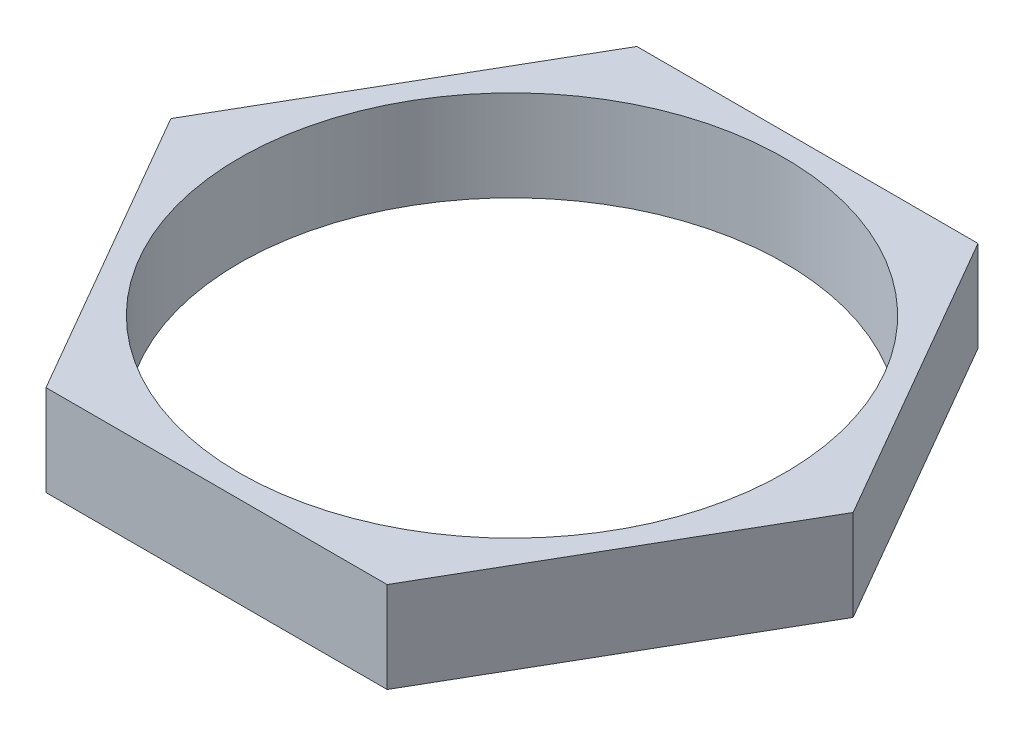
ISO-10303-21;
HEADER;
FILE_DESCRIPTION(('STEP AP214'),'2;1');
FILE_NAME('part.step','',(''),(''),'','','');
FILE_SCHEMA(('AUTOMOTIVE_DESIGN { 1 0 10303 214 1 1 1 1 }'));
ENDSEC;
DATA;
#1=APPLICATION_CONTEXT('core data for automotive mechanical design processes');
#2=APPLICATION_PROTOCOL_DEFINITION('international standard','automotive_design',2000,#1);
#3=PRODUCT_CONTEXT('',#1,'mechanical');
#4=PRODUCT('Part','Part','',(#3));
#5=PRODUCT_RELATED_PRODUCT_CATEGORY('part','',(#4));
#6=PRODUCT_DEFINITION_FORMATION('','',#4);
#7=PRODUCT_DEFINITION_CONTEXT('part definition',#1,'design');
#8=PRODUCT_DEFINITION('design','',#6,#7);
#9=PRODUCT_DEFINITION_SHAPE('','',#8);
#10=(LENGTH_UNIT() NAMED_UNIT(*) SI_UNIT(.MILLI.,.METRE.));
#11=(NAMED_UNIT(*) PLANE_ANGLE_UNIT() SI_UNIT($,.RADIAN.));
#12=(NAMED_UNIT(*) SI_UNIT($,.STERADIAN.) SOLID_ANGLE_UNIT());
#13=UNCERTAINTY_MEASURE_WITH_UNIT(LENGTH_MEASURE(1.E-05),#10,'distance_accuracy_value','');
#14=(GEOMETRIC_REPRESENTATION_CONTEXT(3) GLOBAL_UNCERTAINTY_ASSIGNED_CONTEXT((#13)) GLOBAL_UNIT_ASSIGNED_CONTEXT((#10,
#11,#12)) REPRESENTATION_CONTEXT('',''));
#15=CARTESIAN_POINT('',(0.,0.,0.));
#16=DIRECTION('',(0.,0.,1.));
#17=DIRECTION('',(1.,0.,0.));
#18=AXIS2_PLACEMENT_3D('',#15,#16,#17);
#19=CARTESIAN_POINT('',(5.62916512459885,3.,9.75));
#20=DIRECTION('',(0.,1.,0.));
#21=DIRECTION('',(0.,0.,1.));
#22=AXIS2_PLACEMENT_3D('',#19,#20,#21);
#23=PLANE('',#22);
#24=DIRECTION('',(1.,0.,0.));
#25=VECTOR('',#24,1.);
#26=CARTESIAN_POINT('',(-5.62916512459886,3.,9.75));
#27=LINE('',#26,#25);
#28=CARTESIAN_POINT('',(-5.62916512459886,3.,9.75));
#29=VERTEX_POINT('',#28);
#30=CARTESIAN_POINT('',(5.62916512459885,3.,9.75));
#31=VERTEX_POINT('',#30);
#32=EDGE_CURVE('E133',#29,#31,#27,.T.);
#33=ORIENTED_EDGE('',*,*,#32,.T.);
#34=DIRECTION('',(0.5,0.,-0.866025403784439));
#35=VECTOR('',#34,1.);
#36=CARTESIAN_POINT('',(5.62916512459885,3.,9.75));
#37=LINE('',#36,#35);
#38=CARTESIAN_POINT('',(11.2583302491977,3.,0.));
#39=VERTEX_POINT('',#38);
#40=EDGE_CURVE('E91',#31,#39,#37,.T.);
#41=ORIENTED_EDGE('',*,*,#40,.T.);
#42=DIRECTION('',(-0.5,0.,-0.866025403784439));
#43=VECTOR('',#42,1.);
#44=CARTESIAN_POINT('',(11.2583302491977,3.,0.));
#45=LINE('',#44,#43);
#46=CARTESIAN_POINT('',(5.62916512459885,3.,-9.75));
#47=VERTEX_POINT('',#46);
#48=EDGE_CURVE('E104',#39,#47,#45,.T.);
#49=ORIENTED_EDGE('',*,*,#48,.T.);
#50=DIRECTION('',(-1.,0.,0.));
#51=VECTOR('',#50,1.);
#52=CARTESIAN_POINT('',(5.62916512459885,3.,-9.75));
#53=LINE('',#52,#51);
#54=CARTESIAN_POINT('',(-5.62916512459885,3.,-9.75));
#55=VERTEX_POINT('',#54);
#56=EDGE_CURVE('E98',#47,#55,#53,.T.);
#57=ORIENTED_EDGE('',*,*,#56,.T.);
#58=DIRECTION('',(-0.5,0.,0.866025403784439));
#59=VECTOR('',#58,1.);
#60=CARTESIAN_POINT('',(-5.62916512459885,3.,-9.75));
#61=LINE('',#60,#59);
#62=CARTESIAN_POINT('',(-11.2583302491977,3.,0.));
#63=VERTEX_POINT('',#62);
#64=EDGE_CURVE('E102',#55,#63,#61,.T.);
#65=ORIENTED_EDGE('',*,*,#64,.T.);
#66=DIRECTION('',(0.5,0.,0.866025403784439));
#67=VECTOR('',#66,1.);
#68=CARTESIAN_POINT('',(-11.2583302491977,3.,0.));
#69=LINE('',#68,#67);
#70=EDGE_CURVE('E54',#63,#29,#69,.T.);
#71=ORIENTED_EDGE('',*,*,#70,.T.);
#72=EDGE_LOOP('',(#33,#41,#49,#57,#65,#71));
#73=FACE_BOUND('',#72,.T.);
#74=CARTESIAN_POINT('',(0.,3.,0.));
#75=DIRECTION('',(0.,1.,0.));
#76=DIRECTION('',(0.,0.,1.));
#77=AXIS2_PLACEMENT_3D('',#74,#75,#76);
#78=CIRCLE('',#77,9.);
#79=CARTESIAN_POINT('',(0.,3.,9.));
#80=VERTEX_POINT('',#79);
#81=EDGE_CURVE('E126',#80,#80,#78,.T.);
#82=ORIENTED_EDGE('',*,*,#81,.F.);
#83=EDGE_LOOP('',(#82));
#84=FACE_BOUND('',#83,.T.);
#85=ADVANCED_FACE('F37',(#73,#84),#23,.T.);
#86=CARTESIAN_POINT('',(5.62916512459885,0.,9.75));
#87=DIRECTION('',(0.,1.,0.));
#88=DIRECTION('',(0.,0.,1.));
#89=AXIS2_PLACEMENT_3D('',#86,#87,#88);
#90=PLANE('',#89);
#91=DIRECTION('',(1.,0.,0.));
#92=VECTOR('',#91,1.);
#93=CARTESIAN_POINT('',(-5.62916512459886,0.,9.75));
#94=LINE('',#93,#92);
#95=CARTESIAN_POINT('',(-5.62916512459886,0.,9.75));
#96=VERTEX_POINT('',#95);
#97=CARTESIAN_POINT('',(5.62916512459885,0.,9.75));
#98=VERTEX_POINT('',#97);
#99=EDGE_CURVE('E122',#96,#98,#94,.T.);
#100=ORIENTED_EDGE('',*,*,#99,.F.);
#101=DIRECTION('',(0.5,0.,0.866025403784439));
#102=VECTOR('',#101,1.);
#103=CARTESIAN_POINT('',(-11.2583302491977,0.,0.));
#104=LINE('',#103,#102);
#105=CARTESIAN_POINT('',(-11.2583302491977,0.,0.));
#106=VERTEX_POINT('',#105);
#107=EDGE_CURVE('E83',#106,#96,#104,.T.);
#108=ORIENTED_EDGE('',*,*,#107,.F.);
#109=DIRECTION('',(-0.5,0.,0.866025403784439));
#110=VECTOR('',#109,1.);
#111=CARTESIAN_POINT('',(-5.62916512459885,0.,-9.75));
#112=LINE('',#111,#110);
#113=CARTESIAN_POINT('',(-5.62916512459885,0.,-9.75));
#114=VERTEX_POINT('',#113);
#115=EDGE_CURVE('E77',#114,#106,#112,.T.);
#116=ORIENTED_EDGE('',*,*,#115,.F.);
#117=DIRECTION('',(-1.,0.,0.));
#118=VECTOR('',#117,1.);
#119=CARTESIAN_POINT('',(5.62916512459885,0.,-9.75));
#120=LINE('',#119,#118);
#121=CARTESIAN_POINT('',(5.62916512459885,0.,-9.75));
#122=VERTEX_POINT('',#121);
#123=EDGE_CURVE('E112',#122,#114,#120,.T.);
#124=ORIENTED_EDGE('',*,*,#123,.F.);
#125=DIRECTION('',(-0.5,0.,-0.866025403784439));
#126=VECTOR('',#125,1.);
#127=CARTESIAN_POINT('',(11.2583302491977,0.,0.));
#128=LINE('',#127,#126);
#129=CARTESIAN_POINT('',(11.2583302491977,0.,0.));
#130=VERTEX_POINT('',#129);
#131=EDGE_CURVE('E128',#130,#122,#128,.T.);
#132=ORIENTED_EDGE('',*,*,#131,.F.);
#133=DIRECTION('',(0.5,0.,-0.866025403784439));
#134=VECTOR('',#133,1.);
#135=CARTESIAN_POINT('',(5.62916512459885,0.,9.75));
#136=LINE('',#135,#134);
#137=EDGE_CURVE('E125',#98,#130,#136,.T.);
#138=ORIENTED_EDGE('',*,*,#137,.F.);
#139=EDGE_LOOP('',(#100,#108,#116,#124,#132,#138));
#140=FACE_BOUND('',#139,.T.);
#141=CARTESIAN_POINT('',(0.,0.,0.));
#142=DIRECTION('',(0.,1.,0.));
#143=DIRECTION('',(0.,0.,1.));
#144=AXIS2_PLACEMENT_3D('',#141,#142,#143);
#145=CIRCLE('',#144,9.);
#146=CARTESIAN_POINT('',(0.,0.,9.));
#147=VERTEX_POINT('',#146);
#148=EDGE_CURVE('E226',#147,#147,#145,.T.);
#149=ORIENTED_EDGE('',*,*,#148,.T.);
#150=EDGE_LOOP('',(#149));
#151=FACE_BOUND('',#150,.T.);
#152=ADVANCED_FACE('F142',(#140,#151),#90,.F.);
#153=CARTESIAN_POINT('',(-5.62916512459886,3.,9.75));
#154=DIRECTION('',(0.,0.,-1.));
#155=DIRECTION('',(-1.,0.,0.));
#156=AXIS2_PLACEMENT_3D('',#153,#154,#155);
#157=PLANE('',#156);
#158=ORIENTED_EDGE('',*,*,#99,.T.);
#159=DIRECTION('',(0.,-1.,0.));
#160=VECTOR('',#159,1.);
#161=CARTESIAN_POINT('',(5.62916512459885,3.,9.75));
#162=LINE('',#161,#160);
#163=EDGE_CURVE('E11',#31,#98,#162,.T.);
#164=ORIENTED_EDGE('',*,*,#163,.F.);
#165=ORIENTED_EDGE('',*,*,#32,.F.);
#166=DIRECTION('',(0.,-1.,0.));
#167=VECTOR('',#166,1.);
#168=CARTESIAN_POINT('',(-5.62916512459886,3.,9.75));
#169=LINE('',#168,#167);
#170=EDGE_CURVE('E118',#29,#96,#169,.T.);
#171=ORIENTED_EDGE('',*,*,#170,.T.);
#172=EDGE_LOOP('',(#158,#164,#165,#171));
#173=FACE_BOUND('',#172,.T.);
#174=ADVANCED_FACE('F39',(#173),#157,.F.);
#175=CARTESIAN_POINT('',(5.62916512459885,3.,9.75));
#176=DIRECTION('',(-0.866025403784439,0.,-0.5));
#177=DIRECTION('',(-0.5,0.,0.866025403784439));
#178=AXIS2_PLACEMENT_3D('',#175,#176,#177);
#179=PLANE('',#178);
#180=ORIENTED_EDGE('',*,*,#137,.T.);
#181=DIRECTION('',(0.,-1.,0.));
#182=VECTOR('',#181,1.);
#183=CARTESIAN_POINT('',(11.2583302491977,3.,0.));
#184=LINE('',#183,#182);
#185=EDGE_CURVE('E46',#39,#130,#184,.T.);
#186=ORIENTED_EDGE('',*,*,#185,.F.);
#187=ORIENTED_EDGE('',*,*,#40,.F.);
#188=ORIENTED_EDGE('',*,*,#163,.T.);
#189=EDGE_LOOP('',(#180,#186,#187,#188));
#190=FACE_BOUND('',#189,.T.);
#191=ADVANCED_FACE('F167',(#190),#179,.F.);
#192=CARTESIAN_POINT('',(11.2583302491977,3.,0.));
#193=DIRECTION('',(-0.866025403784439,0.,0.5));
#194=DIRECTION('',(0.5,0.,0.866025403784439));
#195=AXIS2_PLACEMENT_3D('',#192,#193,#194);
#196=PLANE('',#195);
#197=ORIENTED_EDGE('',*,*,#131,.T.);
#198=DIRECTION('',(0.,-1.,0.));
#199=VECTOR('',#198,1.);
#200=CARTESIAN_POINT('',(5.62916512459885,3.,-9.75));
#201=LINE('',#200,#199);
#202=EDGE_CURVE('E113',#47,#122,#201,.T.);
#203=ORIENTED_EDGE('',*,*,#202,.F.);
#204=ORIENTED_EDGE('',*,*,#48,.F.);
#205=ORIENTED_EDGE('',*,*,#185,.T.);
#206=EDGE_LOOP('',(#197,#203,#204,#205));
#207=FACE_BOUND('',#206,.T.);
#208=ADVANCED_FACE('F139',(#207),#196,.F.);
#209=CARTESIAN_POINT('',(5.62916512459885,3.,-9.75));
#210=DIRECTION('',(0.,0.,1.));
#211=DIRECTION('',(1.,0.,0.));
#212=AXIS2_PLACEMENT_3D('',#209,#210,#211);
#213=PLANE('',#212);
#214=ORIENTED_EDGE('',*,*,#123,.T.);
#215=DIRECTION('',(0.,-1.,0.));
#216=VECTOR('',#215,1.);
#217=CARTESIAN_POINT('',(-5.62916512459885,3.,-9.75));
#218=LINE('',#217,#216);
#219=EDGE_CURVE('E109',#55,#114,#218,.T.);
#220=ORIENTED_EDGE('',*,*,#219,.F.);
#221=ORIENTED_EDGE('',*,*,#56,.F.);
#222=ORIENTED_EDGE('',*,*,#202,.T.);
#223=EDGE_LOOP('',(#214,#220,#221,#222));
#224=FACE_BOUND('',#223,.T.);
#225=ADVANCED_FACE('F110',(#224),#213,.F.);
#226=CARTESIAN_POINT('',(-5.62916512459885,3.,-9.75));
#227=DIRECTION('',(0.866025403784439,0.,0.5));
#228=DIRECTION('',(0.5,0.,-0.866025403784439));
#229=AXIS2_PLACEMENT_3D('',#226,#227,#228);
#230=PLANE('',#229);
#231=ORIENTED_EDGE('',*,*,#115,.T.);
#232=DIRECTION('',(0.,-1.,0.));
#233=VECTOR('',#232,1.);
#234=CARTESIAN_POINT('',(-11.2583302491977,3.,0.));
#235=LINE('',#234,#233);
#236=EDGE_CURVE('E114',#63,#106,#235,.T.);
#237=ORIENTED_EDGE('',*,*,#236,.F.);
#238=ORIENTED_EDGE('',*,*,#64,.F.);
#239=ORIENTED_EDGE('',*,*,#219,.T.);
#240=EDGE_LOOP('',(#231,#237,#238,#239));
#241=FACE_BOUND('',#240,.T.);
#242=ADVANCED_FACE('F116',(#241),#230,.F.);
#243=CARTESIAN_POINT('',(-11.2583302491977,3.,0.));
#244=DIRECTION('',(0.866025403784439,0.,-0.5));
#245=DIRECTION('',(-0.5,0.,-0.866025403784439));
#246=AXIS2_PLACEMENT_3D('',#243,#244,#245);
#247=PLANE('',#246);
#248=ORIENTED_EDGE('',*,*,#107,.T.);
#249=ORIENTED_EDGE('',*,*,#170,.F.);
#250=ORIENTED_EDGE('',*,*,#70,.F.);
#251=ORIENTED_EDGE('',*,*,#236,.T.);
#252=EDGE_LOOP('',(#248,#249,#250,#251));
#253=FACE_BOUND('',#252,.T.);
#254=ADVANCED_FACE('F147',(#253),#247,.F.);
#255=CARTESIAN_POINT('',(0.,3.,0.));
#256=DIRECTION('',(0.,-1.,0.));
#257=DIRECTION('',(0.,0.,-1.));
#258=AXIS2_PLACEMENT_3D('',#255,#256,#257);
#259=CYLINDRICAL_SURFACE('',#258,9.);
#260=ORIENTED_EDGE('',*,*,#81,.T.);
#261=EDGE_LOOP('',(#260));
#262=FACE_BOUND('',#261,.T.);
#263=ORIENTED_EDGE('',*,*,#148,.F.);
#264=EDGE_LOOP('',(#263));
#265=FACE_BOUND('',#264,.T.);
#266=ADVANCED_FACE('F149',(#262,#265),#259,.F.);
#267=CLOSED_SHELL('',(#85,#152,#174,#191,#208,#225,#242,#254,#266));
#268=MANIFOLD_SOLID_BREP('B2',#267);
#269=ADVANCED_BREP_SHAPE_REPRESENTATION('',(#18,#268),#14);
#270=SHAPE_DEFINITION_REPRESENTATION(#9,#269);
ENDSEC;
END-ISO-10303-21;
